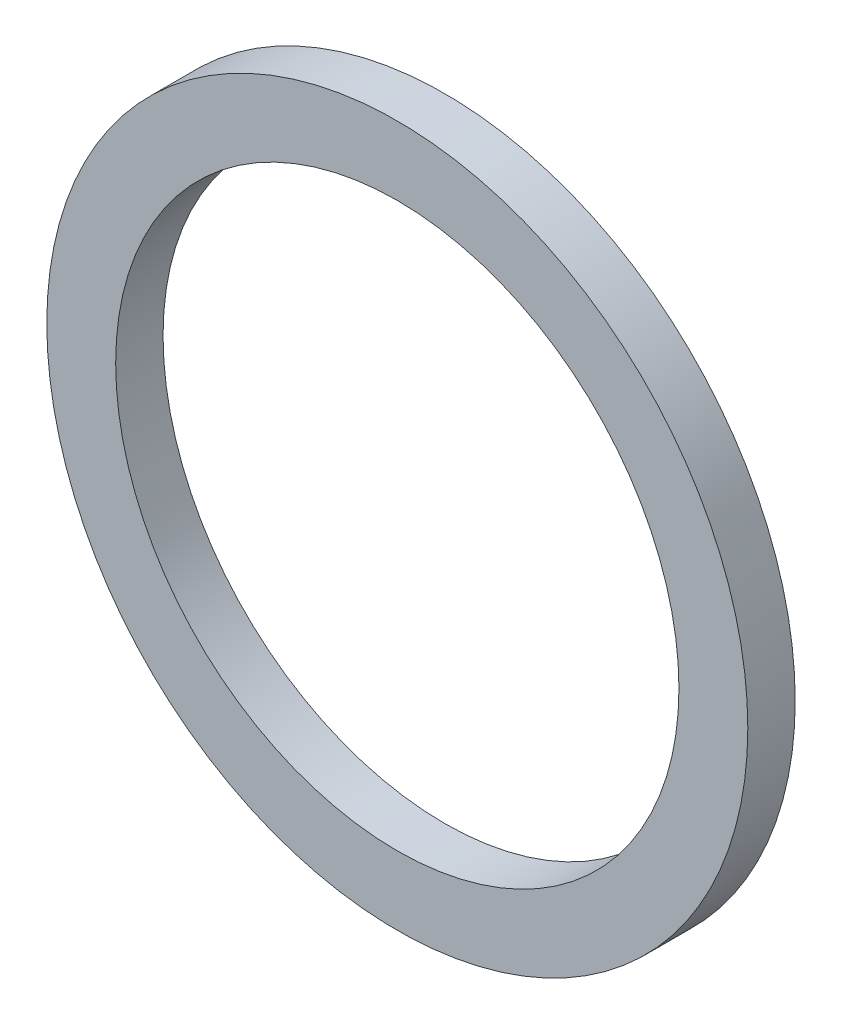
from build123d import *

# Parameters (mm, degrees)
SKETCH1_R          = 11.095
SKETCH1_R_2        = 8.915
BASE_EXTRUDE_DEPTH = 1.5


with BuildPart() as part:
    # Sketch1 → Base-Extrude (new body)
    with BuildSketch(Plane.XY):
        Circle(SKETCH1_R)
        Circle(SKETCH1_R_2, mode=Mode.SUBTRACT)
    extrude(amount=BASE_EXTRUDE_DEPTH)


solid = part.part
